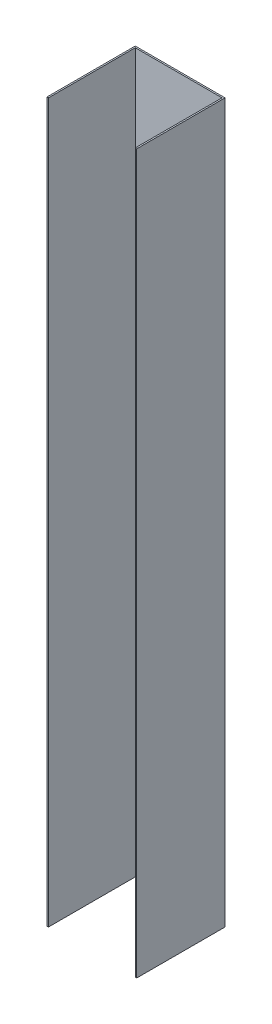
ISO-10303-21;
HEADER;
FILE_DESCRIPTION(('STEP AP214'),'2;1');
FILE_NAME('part.step','',(''),(''),'','','');
FILE_SCHEMA(('AUTOMOTIVE_DESIGN { 1 0 10303 214 1 1 1 1 }'));
ENDSEC;
DATA;
#1=APPLICATION_CONTEXT('core data for automotive mechanical design processes');
#2=APPLICATION_PROTOCOL_DEFINITION('international standard','automotive_design',2000,#1);
#3=PRODUCT_CONTEXT('',#1,'mechanical');
#4=PRODUCT('Part','Part','',(#3));
#5=PRODUCT_RELATED_PRODUCT_CATEGORY('part','',(#4));
#6=PRODUCT_DEFINITION_FORMATION('','',#4);
#7=PRODUCT_DEFINITION_CONTEXT('part definition',#1,'design');
#8=PRODUCT_DEFINITION('design','',#6,#7);
#9=PRODUCT_DEFINITION_SHAPE('','',#8);
#10=(LENGTH_UNIT() NAMED_UNIT(*) SI_UNIT(.MILLI.,.METRE.));
#11=(NAMED_UNIT(*) PLANE_ANGLE_UNIT() SI_UNIT($,.RADIAN.));
#12=(NAMED_UNIT(*) SI_UNIT($,.STERADIAN.) SOLID_ANGLE_UNIT());
#13=UNCERTAINTY_MEASURE_WITH_UNIT(LENGTH_MEASURE(1.E-05),#10,'distance_accuracy_value','');
#14=(GEOMETRIC_REPRESENTATION_CONTEXT(3) GLOBAL_UNCERTAINTY_ASSIGNED_CONTEXT((#13)) GLOBAL_UNIT_ASSIGNED_CONTEXT((#10,
#11,#12)) REPRESENTATION_CONTEXT('',''));
#15=CARTESIAN_POINT('',(0.,0.,0.));
#16=DIRECTION('',(0.,0.,1.));
#17=DIRECTION('',(1.,0.,0.));
#18=AXIS2_PLACEMENT_3D('',#15,#16,#17);
#19=CARTESIAN_POINT('',(-30.,480.,59.));
#20=DIRECTION('',(1.,0.,0.));
#21=DIRECTION('',(0.,0.,-1.));
#22=AXIS2_PLACEMENT_3D('',#19,#20,#21);
#23=PLANE('',#22);
#24=DIRECTION('',(0.,0.,1.));
#25=VECTOR('',#24,1.);
#26=CARTESIAN_POINT('',(-30.,0.,59.));
#27=LINE('',#26,#25);
#28=CARTESIAN_POINT('',(-30.,0.,0.));
#29=VERTEX_POINT('',#28);
#30=CARTESIAN_POINT('',(-30.,0.,59.));
#31=VERTEX_POINT('',#30);
#32=EDGE_CURVE('E130',#29,#31,#27,.T.);
#33=ORIENTED_EDGE('',*,*,#32,.T.);
#34=DIRECTION('',(0.,-1.,0.));
#35=VECTOR('',#34,1.);
#36=CARTESIAN_POINT('',(-30.,480.,59.));
#37=LINE('',#36,#35);
#38=CARTESIAN_POINT('',(-30.,480.,59.));
#39=VERTEX_POINT('',#38);
#40=EDGE_CURVE('E11',#39,#31,#37,.T.);
#41=ORIENTED_EDGE('',*,*,#40,.F.);
#42=DIRECTION('',(0.,0.,1.));
#43=VECTOR('',#42,1.);
#44=CARTESIAN_POINT('',(-30.,480.,59.));
#45=LINE('',#44,#43);
#46=CARTESIAN_POINT('',(-30.,480.,0.));
#47=VERTEX_POINT('',#46);
#48=EDGE_CURVE('E144',#47,#39,#45,.T.);
#49=ORIENTED_EDGE('',*,*,#48,.F.);
#50=DIRECTION('',(0.,-1.,0.));
#51=VECTOR('',#50,1.);
#52=CARTESIAN_POINT('',(-30.,480.,0.));
#53=LINE('',#52,#51);
#54=EDGE_CURVE('E126',#47,#29,#53,.T.);
#55=ORIENTED_EDGE('',*,*,#54,.T.);
#56=EDGE_LOOP('',(#33,#41,#49,#55));
#57=FACE_BOUND('',#56,.T.);
#58=ADVANCED_FACE('F34',(#57),#23,.F.);
#59=CARTESIAN_POINT('',(-29.,480.,59.));
#60=DIRECTION('',(0.,0.,-1.));
#61=DIRECTION('',(-1.,0.,0.));
#62=AXIS2_PLACEMENT_3D('',#59,#60,#61);
#63=PLANE('',#62);
#64=DIRECTION('',(1.,0.,0.));
#65=VECTOR('',#64,1.);
#66=CARTESIAN_POINT('',(-29.,0.,59.));
#67=LINE('',#66,#65);
#68=CARTESIAN_POINT('',(-29.,0.,59.));
#69=VERTEX_POINT('',#68);
#70=EDGE_CURVE('E133',#31,#69,#67,.T.);
#71=ORIENTED_EDGE('',*,*,#70,.T.);
#72=DIRECTION('',(0.,-1.,0.));
#73=VECTOR('',#72,1.);
#74=CARTESIAN_POINT('',(-29.,480.,59.));
#75=LINE('',#74,#73);
#76=CARTESIAN_POINT('',(-29.,480.,59.));
#77=VERTEX_POINT('',#76);
#78=EDGE_CURVE('E42',#77,#69,#75,.T.);
#79=ORIENTED_EDGE('',*,*,#78,.F.);
#80=DIRECTION('',(1.,0.,0.));
#81=VECTOR('',#80,1.);
#82=CARTESIAN_POINT('',(-29.,480.,59.));
#83=LINE('',#82,#81);
#84=EDGE_CURVE('E93',#39,#77,#83,.T.);
#85=ORIENTED_EDGE('',*,*,#84,.F.);
#86=ORIENTED_EDGE('',*,*,#40,.T.);
#87=EDGE_LOOP('',(#71,#79,#85,#86));
#88=FACE_BOUND('',#87,.T.);
#89=ADVANCED_FACE('F179',(#88),#63,.F.);
#90=CARTESIAN_POINT('',(-29.,480.,1.00000000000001));
#91=DIRECTION('',(-1.,0.,0.));
#92=DIRECTION('',(0.,0.,1.));
#93=AXIS2_PLACEMENT_3D('',#90,#91,#92);
#94=PLANE('',#93);
#95=DIRECTION('',(0.,0.,-1.));
#96=VECTOR('',#95,1.);
#97=CARTESIAN_POINT('',(-29.,0.,1.00000000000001));
#98=LINE('',#97,#96);
#99=CARTESIAN_POINT('',(-29.,0.,1.00000000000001));
#100=VERTEX_POINT('',#99);
#101=EDGE_CURVE('E135',#69,#100,#98,.T.);
#102=ORIENTED_EDGE('',*,*,#101,.T.);
#103=DIRECTION('',(0.,-1.,0.));
#104=VECTOR('',#103,1.);
#105=CARTESIAN_POINT('',(-29.,480.,1.00000000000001));
#106=LINE('',#105,#104);
#107=CARTESIAN_POINT('',(-29.,480.,1.00000000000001));
#108=VERTEX_POINT('',#107);
#109=EDGE_CURVE('E151',#108,#100,#106,.T.);
#110=ORIENTED_EDGE('',*,*,#109,.F.);
#111=DIRECTION('',(0.,0.,-1.));
#112=VECTOR('',#111,1.);
#113=CARTESIAN_POINT('',(-29.,480.,1.00000000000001));
#114=LINE('',#113,#112);
#115=EDGE_CURVE('E159',#77,#108,#114,.T.);
#116=ORIENTED_EDGE('',*,*,#115,.F.);
#117=ORIENTED_EDGE('',*,*,#78,.T.);
#118=EDGE_LOOP('',(#102,#110,#116,#117));
#119=FACE_BOUND('',#118,.T.);
#120=ADVANCED_FACE('F157',(#119),#94,.F.);
#121=CARTESIAN_POINT('',(29.,480.,1.00000000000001));
#122=DIRECTION('',(0.,0.,-1.));
#123=DIRECTION('',(-1.,0.,0.));
#124=AXIS2_PLACEMENT_3D('',#121,#122,#123);
#125=PLANE('',#124);
#126=DIRECTION('',(1.,0.,0.));
#127=VECTOR('',#126,1.);
#128=CARTESIAN_POINT('',(29.,0.,1.00000000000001));
#129=LINE('',#128,#127);
#130=CARTESIAN_POINT('',(29.,0.,1.00000000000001));
#131=VERTEX_POINT('',#130);
#132=EDGE_CURVE('E137',#100,#131,#129,.T.);
#133=ORIENTED_EDGE('',*,*,#132,.T.);
#134=DIRECTION('',(0.,-1.,0.));
#135=VECTOR('',#134,1.);
#136=CARTESIAN_POINT('',(29.,480.,1.00000000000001));
#137=LINE('',#136,#135);
#138=CARTESIAN_POINT('',(29.,480.,1.00000000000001));
#139=VERTEX_POINT('',#138);
#140=EDGE_CURVE('E148',#139,#131,#137,.T.);
#141=ORIENTED_EDGE('',*,*,#140,.F.);
#142=DIRECTION('',(1.,0.,0.));
#143=VECTOR('',#142,1.);
#144=CARTESIAN_POINT('',(29.,480.,1.00000000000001));
#145=LINE('',#144,#143);
#146=EDGE_CURVE('E171',#108,#139,#145,.T.);
#147=ORIENTED_EDGE('',*,*,#146,.F.);
#148=ORIENTED_EDGE('',*,*,#109,.T.);
#149=EDGE_LOOP('',(#133,#141,#147,#148));
#150=FACE_BOUND('',#149,.T.);
#151=ADVANCED_FACE('F167',(#150),#125,.F.);
#152=CARTESIAN_POINT('',(29.,480.,59.));
#153=DIRECTION('',(1.,0.,0.));
#154=DIRECTION('',(0.,0.,-1.));
#155=AXIS2_PLACEMENT_3D('',#152,#153,#154);
#156=PLANE('',#155);
#157=DIRECTION('',(0.,0.,1.));
#158=VECTOR('',#157,1.);
#159=CARTESIAN_POINT('',(29.,0.,59.));
#160=LINE('',#159,#158);
#161=CARTESIAN_POINT('',(29.,0.,59.));
#162=VERTEX_POINT('',#161);
#163=EDGE_CURVE('E139',#131,#162,#160,.T.);
#164=ORIENTED_EDGE('',*,*,#163,.T.);
#165=DIRECTION('',(0.,-1.,0.));
#166=VECTOR('',#165,1.);
#167=CARTESIAN_POINT('',(29.,480.,59.));
#168=LINE('',#167,#166);
#169=CARTESIAN_POINT('',(29.,480.,59.));
#170=VERTEX_POINT('',#169);
#171=EDGE_CURVE('E121',#170,#162,#168,.T.);
#172=ORIENTED_EDGE('',*,*,#171,.F.);
#173=DIRECTION('',(0.,0.,1.));
#174=VECTOR('',#173,1.);
#175=CARTESIAN_POINT('',(29.,480.,59.));
#176=LINE('',#175,#174);
#177=EDGE_CURVE('E112',#139,#170,#176,.T.);
#178=ORIENTED_EDGE('',*,*,#177,.F.);
#179=ORIENTED_EDGE('',*,*,#140,.T.);
#180=EDGE_LOOP('',(#164,#172,#178,#179));
#181=FACE_BOUND('',#180,.T.);
#182=ADVANCED_FACE('F170',(#181),#156,.F.);
#183=CARTESIAN_POINT('',(30.,480.,59.));
#184=DIRECTION('',(0.,0.,-1.));
#185=DIRECTION('',(-1.,0.,0.));
#186=AXIS2_PLACEMENT_3D('',#183,#184,#185);
#187=PLANE('',#186);
#188=DIRECTION('',(1.,0.,0.));
#189=VECTOR('',#188,1.);
#190=CARTESIAN_POINT('',(30.,0.,59.));
#191=LINE('',#190,#189);
#192=CARTESIAN_POINT('',(30.,0.,59.));
#193=VERTEX_POINT('',#192);
#194=EDGE_CURVE('E120',#162,#193,#191,.T.);
#195=ORIENTED_EDGE('',*,*,#194,.T.);
#196=DIRECTION('',(0.,-1.,0.));
#197=VECTOR('',#196,1.);
#198=CARTESIAN_POINT('',(30.,480.,59.));
#199=LINE('',#198,#197);
#200=CARTESIAN_POINT('',(30.,480.,59.));
#201=VERTEX_POINT('',#200);
#202=EDGE_CURVE('E117',#201,#193,#199,.T.);
#203=ORIENTED_EDGE('',*,*,#202,.F.);
#204=DIRECTION('',(1.,0.,0.));
#205=VECTOR('',#204,1.);
#206=CARTESIAN_POINT('',(30.,480.,59.));
#207=LINE('',#206,#205);
#208=EDGE_CURVE('E106',#170,#201,#207,.T.);
#209=ORIENTED_EDGE('',*,*,#208,.F.);
#210=ORIENTED_EDGE('',*,*,#171,.T.);
#211=EDGE_LOOP('',(#195,#203,#209,#210));
#212=FACE_BOUND('',#211,.T.);
#213=ADVANCED_FACE('F118',(#212),#187,.F.);
#214=CARTESIAN_POINT('',(30.,480.,0.));
#215=DIRECTION('',(-1.,0.,0.));
#216=DIRECTION('',(0.,0.,1.));
#217=AXIS2_PLACEMENT_3D('',#214,#215,#216);
#218=PLANE('',#217);
#219=DIRECTION('',(0.,0.,-1.));
#220=VECTOR('',#219,1.);
#221=CARTESIAN_POINT('',(30.,0.,0.));
#222=LINE('',#221,#220);
#223=CARTESIAN_POINT('',(30.,0.,0.));
#224=VERTEX_POINT('',#223);
#225=EDGE_CURVE('E79',#193,#224,#222,.T.);
#226=ORIENTED_EDGE('',*,*,#225,.T.);
#227=DIRECTION('',(0.,-1.,0.));
#228=VECTOR('',#227,1.);
#229=CARTESIAN_POINT('',(30.,480.,0.));
#230=LINE('',#229,#228);
#231=CARTESIAN_POINT('',(30.,480.,0.));
#232=VERTEX_POINT('',#231);
#233=EDGE_CURVE('E122',#232,#224,#230,.T.);
#234=ORIENTED_EDGE('',*,*,#233,.F.);
#235=DIRECTION('',(0.,0.,-1.));
#236=VECTOR('',#235,1.);
#237=CARTESIAN_POINT('',(30.,480.,0.));
#238=LINE('',#237,#236);
#239=EDGE_CURVE('E110',#201,#232,#238,.T.);
#240=ORIENTED_EDGE('',*,*,#239,.F.);
#241=ORIENTED_EDGE('',*,*,#202,.T.);
#242=EDGE_LOOP('',(#226,#234,#240,#241));
#243=FACE_BOUND('',#242,.T.);
#244=ADVANCED_FACE('F124',(#243),#218,.F.);
#245=CARTESIAN_POINT('',(-30.,480.,0.));
#246=DIRECTION('',(0.,0.,1.));
#247=DIRECTION('',(1.,0.,0.));
#248=AXIS2_PLACEMENT_3D('',#245,#246,#247);
#249=PLANE('',#248);
#250=DIRECTION('',(-1.,0.,0.));
#251=VECTOR('',#250,1.);
#252=CARTESIAN_POINT('',(-30.,0.,0.));
#253=LINE('',#252,#251);
#254=EDGE_CURVE('E85',#224,#29,#253,.T.);
#255=ORIENTED_EDGE('',*,*,#254,.T.);
#256=ORIENTED_EDGE('',*,*,#54,.F.);
#257=DIRECTION('',(-1.,0.,0.));
#258=VECTOR('',#257,1.);
#259=CARTESIAN_POINT('',(-30.,480.,0.));
#260=LINE('',#259,#258);
#261=EDGE_CURVE('E50',#232,#47,#260,.T.);
#262=ORIENTED_EDGE('',*,*,#261,.F.);
#263=ORIENTED_EDGE('',*,*,#233,.T.);
#264=EDGE_LOOP('',(#255,#256,#262,#263));
#265=FACE_BOUND('',#264,.T.);
#266=ADVANCED_FACE('F195',(#265),#249,.F.);
#267=CARTESIAN_POINT('',(-30.,480.,0.));
#268=DIRECTION('',(0.,-1.,0.));
#269=DIRECTION('',(0.,0.,-1.));
#270=AXIS2_PLACEMENT_3D('',#267,#268,#269);
#271=PLANE('',#270);
#272=ORIENTED_EDGE('',*,*,#48,.T.);
#273=ORIENTED_EDGE('',*,*,#84,.T.);
#274=ORIENTED_EDGE('',*,*,#115,.T.);
#275=ORIENTED_EDGE('',*,*,#146,.T.);
#276=ORIENTED_EDGE('',*,*,#177,.T.);
#277=ORIENTED_EDGE('',*,*,#208,.T.);
#278=ORIENTED_EDGE('',*,*,#239,.T.);
#279=ORIENTED_EDGE('',*,*,#261,.T.);
#280=EDGE_LOOP('',(#272,#273,#274,#275,#276,#277,#278,#279));
#281=FACE_BOUND('',#280,.T.);
#282=ADVANCED_FACE('F108',(#281),#271,.F.);
#283=CARTESIAN_POINT('',(-30.,0.,0.));
#284=DIRECTION('',(0.,-1.,0.));
#285=DIRECTION('',(0.,0.,-1.));
#286=AXIS2_PLACEMENT_3D('',#283,#284,#285);
#287=PLANE('',#286);
#288=ORIENTED_EDGE('',*,*,#32,.F.);
#289=ORIENTED_EDGE('',*,*,#254,.F.);
#290=ORIENTED_EDGE('',*,*,#225,.F.);
#291=ORIENTED_EDGE('',*,*,#194,.F.);
#292=ORIENTED_EDGE('',*,*,#163,.F.);
#293=ORIENTED_EDGE('',*,*,#132,.F.);
#294=ORIENTED_EDGE('',*,*,#101,.F.);
#295=ORIENTED_EDGE('',*,*,#70,.F.);
#296=EDGE_LOOP('',(#288,#289,#290,#291,#292,#293,#294,#295));
#297=FACE_BOUND('',#296,.T.);
#298=ADVANCED_FACE('F163',(#297),#287,.T.);
#299=CLOSED_SHELL('',(#58,#89,#120,#151,#182,#213,#244,#266,#282,#298));
#300=MANIFOLD_SOLID_BREP('B2',#299);
#301=ADVANCED_BREP_SHAPE_REPRESENTATION('',(#18,#300),#14);
#302=SHAPE_DEFINITION_REPRESENTATION(#9,#301);
ENDSEC;
END-ISO-10303-21;
